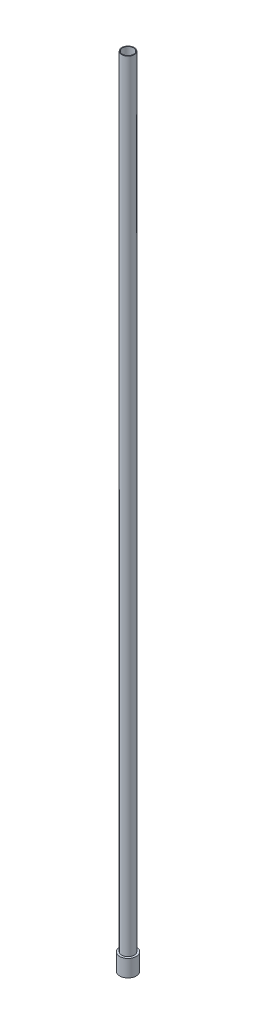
from build123d import *


with BuildPart() as part:
    # Sketch2 → Revolve1 (revolve)
    with BuildSketch(Plane.XY, mode=Mode.PRIVATE) as revolve1_sk:
        Polygon((-2.1209, 0), (-3.175, 0), (-3.175, 6.477), (-2.3749, 6.477), (-2.3749, 304.8), (-2.1209, 304.8), align=None)
    revolve(revolve1_sk.sketch.rotate(Axis((0, 0, 0), (0, 1, 0)), 270), axis=Axis((0, 0, 0), (0, 1, 0)))


solid = part.part
